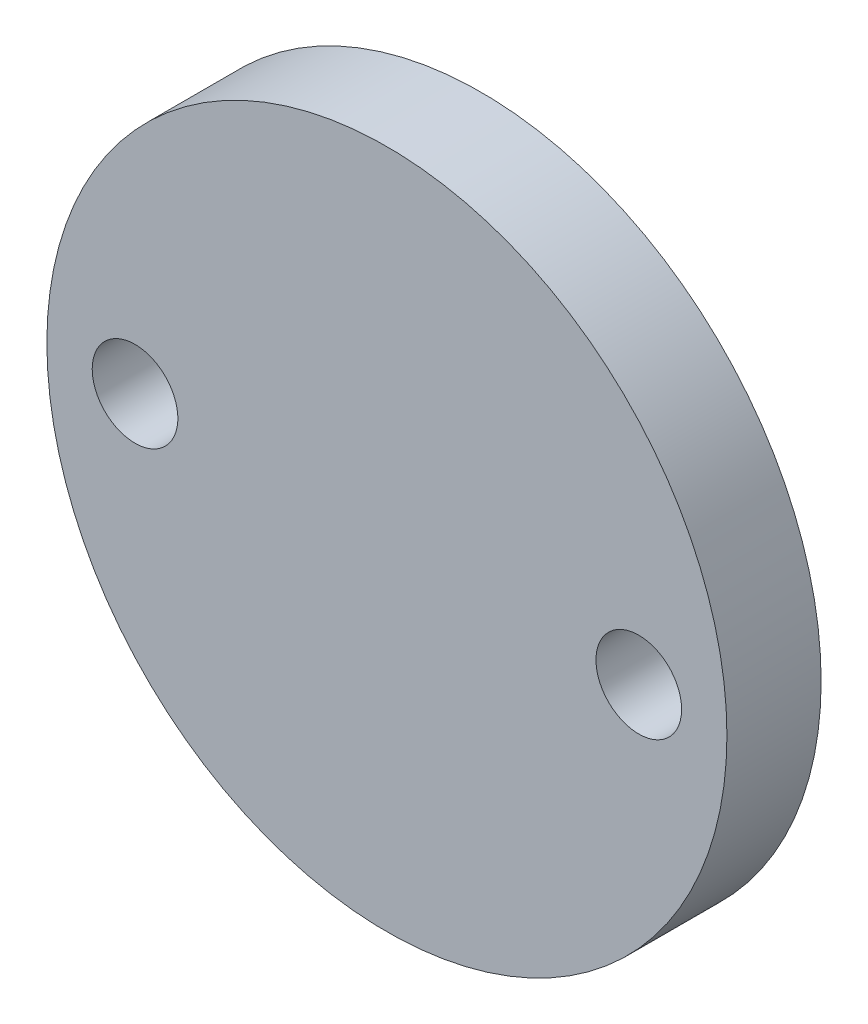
ISO-10303-21;
HEADER;
FILE_DESCRIPTION(('STEP AP214'),'2;1');
FILE_NAME('part.step','',(''),(''),'','','');
FILE_SCHEMA(('AUTOMOTIVE_DESIGN { 1 0 10303 214 1 1 1 1 }'));
ENDSEC;
DATA;
#1=APPLICATION_CONTEXT('core data for automotive mechanical design processes');
#2=APPLICATION_PROTOCOL_DEFINITION('international standard','automotive_design',2000,#1);
#3=PRODUCT_CONTEXT('',#1,'mechanical');
#4=PRODUCT('Part','Part','',(#3));
#5=PRODUCT_RELATED_PRODUCT_CATEGORY('part','',(#4));
#6=PRODUCT_DEFINITION_FORMATION('','',#4);
#7=PRODUCT_DEFINITION_CONTEXT('part definition',#1,'design');
#8=PRODUCT_DEFINITION('design','',#6,#7);
#9=PRODUCT_DEFINITION_SHAPE('','',#8);
#10=(LENGTH_UNIT() NAMED_UNIT(*) SI_UNIT(.MILLI.,.METRE.));
#11=(NAMED_UNIT(*) PLANE_ANGLE_UNIT() SI_UNIT($,.RADIAN.));
#12=(NAMED_UNIT(*) SI_UNIT($,.STERADIAN.) SOLID_ANGLE_UNIT());
#13=UNCERTAINTY_MEASURE_WITH_UNIT(LENGTH_MEASURE(1.E-05),#10,'distance_accuracy_value','');
#14=(GEOMETRIC_REPRESENTATION_CONTEXT(3) GLOBAL_UNCERTAINTY_ASSIGNED_CONTEXT((#13)) GLOBAL_UNIT_ASSIGNED_CONTEXT((#10,
#11,#12)) REPRESENTATION_CONTEXT('',''));
#15=CARTESIAN_POINT('',(0.,0.,0.));
#16=DIRECTION('',(0.,0.,1.));
#17=DIRECTION('',(1.,0.,0.));
#18=AXIS2_PLACEMENT_3D('',#15,#16,#17);
#19=CARTESIAN_POINT('',(0.,0.,4.7498));
#20=DIRECTION('',(0.,0.,1.));
#21=DIRECTION('',(1.,0.,0.));
#22=AXIS2_PLACEMENT_3D('',#19,#20,#21);
#23=PLANE('',#22);
#24=CARTESIAN_POINT('',(0.,0.,4.7498));
#25=DIRECTION('',(0.,0.,1.));
#26=DIRECTION('',(1.,0.,0.));
#27=AXIS2_PLACEMENT_3D('',#24,#25,#26);
#28=CIRCLE('',#27,17.145);
#29=CARTESIAN_POINT('',(17.145,0.,4.7498));
#30=VERTEX_POINT('',#29);
#31=EDGE_CURVE('E10',#30,#30,#28,.T.);
#32=ORIENTED_EDGE('',*,*,#31,.T.);
#33=EDGE_LOOP('',(#32));
#34=FACE_BOUND('',#33,.T.);
#35=CARTESIAN_POINT('',(12.7,0.,4.7498));
#36=DIRECTION('',(0.,0.,1.));
#37=DIRECTION('',(1.,0.,0.));
#38=AXIS2_PLACEMENT_3D('',#35,#36,#37);
#39=CIRCLE('',#38,2.159);
#40=CARTESIAN_POINT('',(14.859,0.,4.7498));
#41=VERTEX_POINT('',#40);
#42=EDGE_CURVE('E48',#41,#41,#39,.T.);
#43=ORIENTED_EDGE('',*,*,#42,.F.);
#44=EDGE_LOOP('',(#43));
#45=FACE_BOUND('',#44,.T.);
#46=CARTESIAN_POINT('',(-12.7,0.,4.7498));
#47=DIRECTION('',(0.,0.,-1.));
#48=DIRECTION('',(-1.,0.,0.));
#49=AXIS2_PLACEMENT_3D('',#46,#47,#48);
#50=CIRCLE('',#49,2.159);
#51=CARTESIAN_POINT('',(-14.859,0.,4.7498));
#52=VERTEX_POINT('',#51);
#53=EDGE_CURVE('E56',#52,#52,#50,.T.);
#54=ORIENTED_EDGE('',*,*,#53,.T.);
#55=EDGE_LOOP('',(#54));
#56=FACE_BOUND('',#55,.T.);
#57=ADVANCED_FACE('F33',(#34,#45,#56),#23,.T.);
#58=CARTESIAN_POINT('',(0.,0.,0.));
#59=DIRECTION('',(0.,0.,1.));
#60=DIRECTION('',(1.,0.,0.));
#61=AXIS2_PLACEMENT_3D('',#58,#59,#60);
#62=PLANE('',#61);
#63=CARTESIAN_POINT('',(0.,0.,0.));
#64=DIRECTION('',(0.,0.,1.));
#65=DIRECTION('',(1.,0.,0.));
#66=AXIS2_PLACEMENT_3D('',#63,#64,#65);
#67=CIRCLE('',#66,17.145);
#68=CARTESIAN_POINT('',(17.145,0.,0.));
#69=VERTEX_POINT('',#68);
#70=EDGE_CURVE('E40',#69,#69,#67,.T.);
#71=ORIENTED_EDGE('',*,*,#70,.F.);
#72=EDGE_LOOP('',(#71));
#73=FACE_BOUND('',#72,.T.);
#74=CARTESIAN_POINT('',(12.7,0.,0.));
#75=DIRECTION('',(0.,0.,1.));
#76=DIRECTION('',(1.,0.,0.));
#77=AXIS2_PLACEMENT_3D('',#74,#75,#76);
#78=CIRCLE('',#77,2.159);
#79=CARTESIAN_POINT('',(14.859,0.,0.));
#80=VERTEX_POINT('',#79);
#81=EDGE_CURVE('E44',#80,#80,#78,.T.);
#82=ORIENTED_EDGE('',*,*,#81,.T.);
#83=EDGE_LOOP('',(#82));
#84=FACE_BOUND('',#83,.T.);
#85=CARTESIAN_POINT('',(-12.7,0.,0.));
#86=DIRECTION('',(0.,0.,-1.));
#87=DIRECTION('',(-1.,0.,0.));
#88=AXIS2_PLACEMENT_3D('',#85,#86,#87);
#89=CIRCLE('',#88,2.159);
#90=CARTESIAN_POINT('',(-14.859,0.,0.));
#91=VERTEX_POINT('',#90);
#92=EDGE_CURVE('E53',#91,#91,#89,.T.);
#93=ORIENTED_EDGE('',*,*,#92,.F.);
#94=EDGE_LOOP('',(#93));
#95=FACE_BOUND('',#94,.T.);
#96=ADVANCED_FACE('F72',(#73,#84,#95),#62,.F.);
#97=CARTESIAN_POINT('',(0.,0.,4.7498));
#98=DIRECTION('',(0.,0.,-1.));
#99=DIRECTION('',(-1.,0.,0.));
#100=AXIS2_PLACEMENT_3D('',#97,#98,#99);
#101=CYLINDRICAL_SURFACE('',#100,17.145);
#102=ORIENTED_EDGE('',*,*,#31,.F.);
#103=EDGE_LOOP('',(#102));
#104=FACE_BOUND('',#103,.T.);
#105=ORIENTED_EDGE('',*,*,#70,.T.);
#106=EDGE_LOOP('',(#105));
#107=FACE_BOUND('',#106,.T.);
#108=ADVANCED_FACE('F35',(#104,#107),#101,.T.);
#109=CARTESIAN_POINT('',(12.7,0.,0.));
#110=DIRECTION('',(0.,0.,1.));
#111=DIRECTION('',(1.,0.,0.));
#112=AXIS2_PLACEMENT_3D('',#109,#110,#111);
#113=CYLINDRICAL_SURFACE('',#112,2.159);
#114=ORIENTED_EDGE('',*,*,#81,.F.);
#115=EDGE_LOOP('',(#114));
#116=FACE_BOUND('',#115,.T.);
#117=ORIENTED_EDGE('',*,*,#42,.T.);
#118=EDGE_LOOP('',(#117));
#119=FACE_BOUND('',#118,.T.);
#120=ADVANCED_FACE('F63',(#116,#119),#113,.F.);
#121=CARTESIAN_POINT('',(-12.7,0.,0.));
#122=DIRECTION('',(0.,0.,1.));
#123=DIRECTION('',(1.,0.,0.));
#124=AXIS2_PLACEMENT_3D('',#121,#122,#123);
#125=CYLINDRICAL_SURFACE('',#124,2.159);
#126=ORIENTED_EDGE('',*,*,#92,.T.);
#127=EDGE_LOOP('',(#126));
#128=FACE_BOUND('',#127,.T.);
#129=ORIENTED_EDGE('',*,*,#53,.F.);
#130=EDGE_LOOP('',(#129));
#131=FACE_BOUND('',#130,.T.);
#132=ADVANCED_FACE('F61',(#128,#131),#125,.F.);
#133=CLOSED_SHELL('',(#57,#96,#108,#120,#132));
#134=MANIFOLD_SOLID_BREP('B2',#133);
#135=ADVANCED_BREP_SHAPE_REPRESENTATION('',(#18,#134),#14);
#136=SHAPE_DEFINITION_REPRESENTATION(#9,#135);
ENDSEC;
END-ISO-10303-21;
